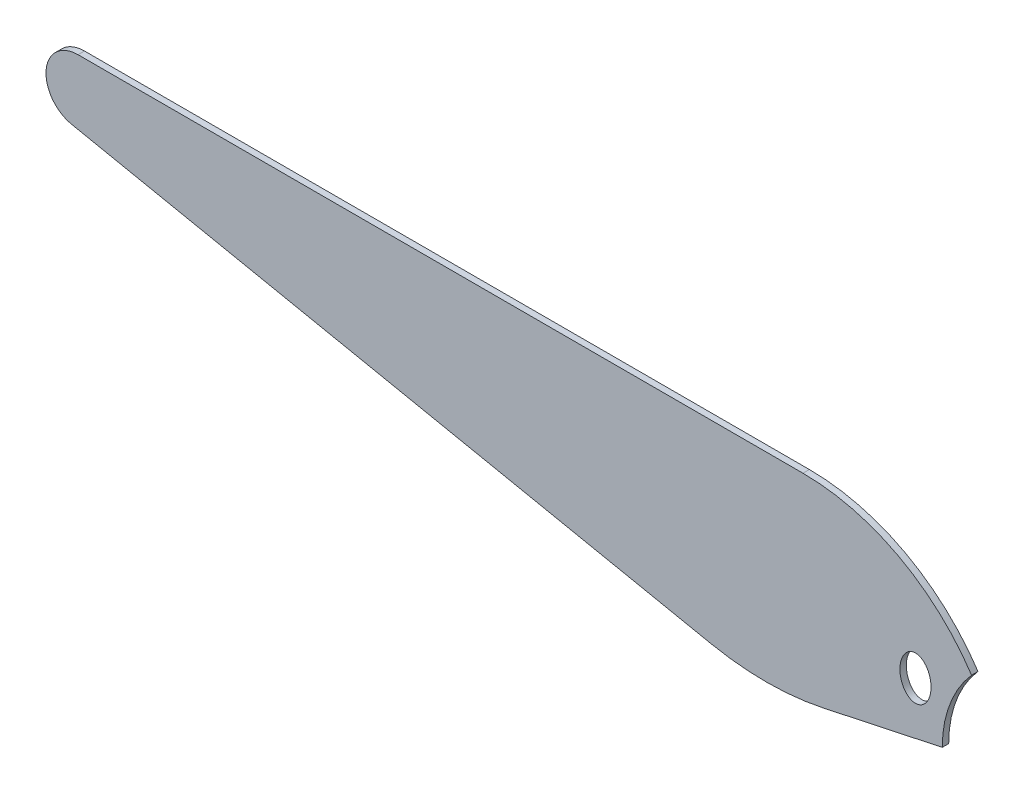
from build123d import *

# Parameters (mm, degrees)
BOSS_EXTRU_1_DEPTH      = 1
ESQUISSE2_RX            = 3.394593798
ESQUISSE2_RY            = 2.421311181
ENL_V_MAT_EXTRU_1_DEPTH = 142.618111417


with BuildPart() as part:
    # Esquisse1 → Boss.-Extru.1 (new body)
    with BuildSketch(Plane.XY):
        with BuildLine():
            Line((0, 5), (112.932501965, 5))
            ThreePointArc((112.932501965, 5), (127.843763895, 1.24714882), (139.20202602, -9.117189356))
            ThreePointArc((139.20202602, -9.117189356), (135.81552636, -14.707869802), (134.635665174, -21.13686781))
            Line((134.635665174, -21.13686781), (116.145661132, -25.082631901))
            ThreePointArc((116.145661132, -25.082631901), (107.385392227, -26.028062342), (98.61650843, -25.166188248))
            Line((98.61650843, -25.166188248), (-0.996839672, -4.899623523))
            ThreePointArc((-0.996839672, -4.899623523), (-4.974842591, 0.500940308), (0, 5))
        make_face()
    extrude(amount=BOSS_EXTRU_1_DEPTH)

    # Esquisse2 → Enl_v. mat.-Extru.1 (cut, through all)
    with BuildSketch(Plane.XY.offset(1)):
        with Locations(Location((130.46034345, -13.885706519), (0, 0, -90))):
            Ellipse(ESQUISSE2_RX, ESQUISSE2_RY)
    extrude(amount=-ENL_V_MAT_EXTRU_1_DEPTH, mode=Mode.SUBTRACT)


solid = part.part
